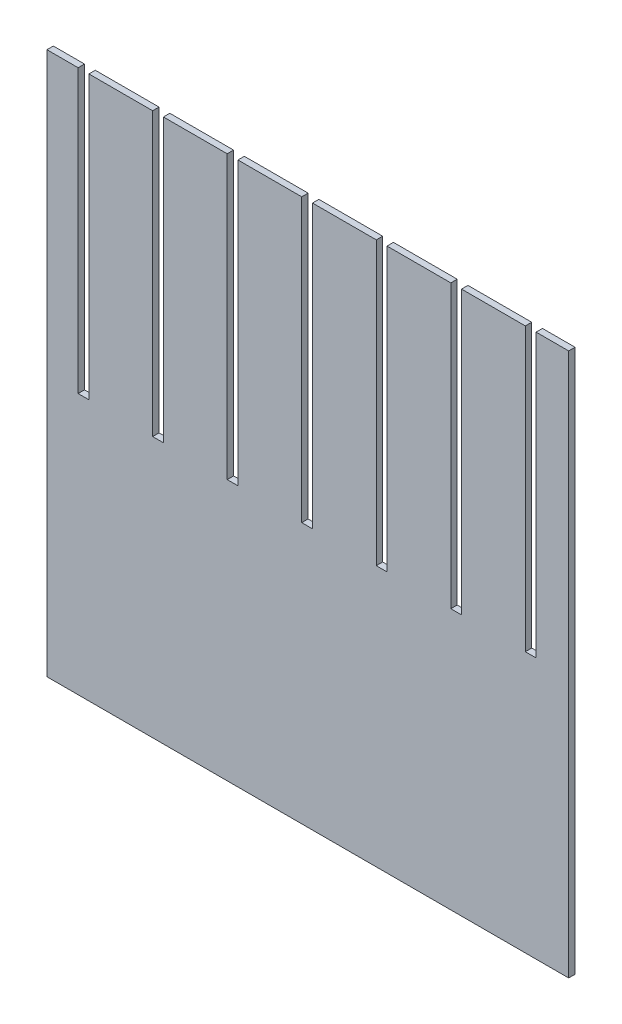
ISO-10303-21;
HEADER;
FILE_DESCRIPTION(('STEP AP214'),'2;1');
FILE_NAME('part.step','',(''),(''),'','','');
FILE_SCHEMA(('AUTOMOTIVE_DESIGN { 1 0 10303 214 1 1 1 1 }'));
ENDSEC;
DATA;
#1=APPLICATION_CONTEXT('core data for automotive mechanical design processes');
#2=APPLICATION_PROTOCOL_DEFINITION('international standard','automotive_design',2000,#1);
#3=PRODUCT_CONTEXT('',#1,'mechanical');
#4=PRODUCT('Part','Part','',(#3));
#5=PRODUCT_RELATED_PRODUCT_CATEGORY('part','',(#4));
#6=PRODUCT_DEFINITION_FORMATION('','',#4);
#7=PRODUCT_DEFINITION_CONTEXT('part definition',#1,'design');
#8=PRODUCT_DEFINITION('design','',#6,#7);
#9=PRODUCT_DEFINITION_SHAPE('','',#8);
#10=(LENGTH_UNIT() NAMED_UNIT(*) SI_UNIT(.MILLI.,.METRE.));
#11=(NAMED_UNIT(*) PLANE_ANGLE_UNIT() SI_UNIT($,.RADIAN.));
#12=(NAMED_UNIT(*) SI_UNIT($,.STERADIAN.) SOLID_ANGLE_UNIT());
#13=UNCERTAINTY_MEASURE_WITH_UNIT(LENGTH_MEASURE(1.E-05),#10,'distance_accuracy_value','');
#14=(GEOMETRIC_REPRESENTATION_CONTEXT(3) GLOBAL_UNCERTAINTY_ASSIGNED_CONTEXT((#13)) GLOBAL_UNIT_ASSIGNED_CONTEXT((#10,
#11,#12)) REPRESENTATION_CONTEXT('',''));
#15=CARTESIAN_POINT('',(0.,0.,0.));
#16=DIRECTION('',(0.,0.,1.));
#17=DIRECTION('',(1.,0.,0.));
#18=AXIS2_PLACEMENT_3D('',#15,#16,#17);
#19=CARTESIAN_POINT('',(-2.93,25.5,0.6));
#20=DIRECTION('',(0.,-1.,0.));
#21=DIRECTION('',(0.,0.,-1.));
#22=AXIS2_PLACEMENT_3D('',#19,#20,#21);
#23=PLANE('',#22);
#24=DIRECTION('',(0.,0.,-1.));
#25=VECTOR('',#24,1.);
#26=CARTESIAN_POINT('',(7.,25.5,0.6));
#27=LINE('',#26,#25);
#28=CARTESIAN_POINT('',(7.,25.5,0.6));
#29=VERTEX_POINT('',#28);
#30=CARTESIAN_POINT('',(7.,25.5,0.));
#31=VERTEX_POINT('',#30);
#32=EDGE_CURVE('E260',#29,#31,#27,.T.);
#33=ORIENTED_EDGE('',*,*,#32,.T.);
#34=DIRECTION('',(-1.,0.,0.));
#35=VECTOR('',#34,1.);
#36=CARTESIAN_POINT('',(-2.93,25.5,0.));
#37=LINE('',#36,#35);
#38=CARTESIAN_POINT('',(1.01,25.5,0.));
#39=VERTEX_POINT('',#38);
#40=EDGE_CURVE('E469',#31,#39,#37,.T.);
#41=ORIENTED_EDGE('',*,*,#40,.T.);
#42=DIRECTION('',(0.,0.,-1.));
#43=VECTOR('',#42,1.);
#44=CARTESIAN_POINT('',(1.01,25.5,0.6));
#45=LINE('',#44,#43);
#46=CARTESIAN_POINT('',(1.01,25.5,0.6));
#47=VERTEX_POINT('',#46);
#48=EDGE_CURVE('E423',#47,#39,#45,.T.);
#49=ORIENTED_EDGE('',*,*,#48,.F.);
#50=DIRECTION('',(-1.,0.,0.));
#51=VECTOR('',#50,1.);
#52=CARTESIAN_POINT('',(-2.93,25.5,0.6));
#53=LINE('',#52,#51);
#54=EDGE_CURVE('E454',#29,#47,#53,.T.);
#55=ORIENTED_EDGE('',*,*,#54,.F.);
#56=EDGE_LOOP('',(#33,#41,#49,#55));
#57=FACE_BOUND('',#56,.T.);
#58=ADVANCED_FACE('F45',(#57),#23,.F.);
#59=DIRECTION('',(0.,0.,-1.));
#60=VECTOR('',#59,1.);
#61=CARTESIAN_POINT('',(8.01,25.5,0.6));
#62=LINE('',#61,#60);
#63=CARTESIAN_POINT('',(8.01,25.5,0.6));
#64=VERTEX_POINT('',#63);
#65=CARTESIAN_POINT('',(8.01,25.5,0.));
#66=VERTEX_POINT('',#65);
#67=EDGE_CURVE('E61',#64,#66,#62,.T.);
#68=ORIENTED_EDGE('',*,*,#67,.F.);
#69=CARTESIAN_POINT('',(14.,25.5,0.6));
#70=VERTEX_POINT('',#69);
#71=EDGE_CURVE('E554',#70,#64,#53,.T.);
#72=ORIENTED_EDGE('',*,*,#71,.F.);
#73=DIRECTION('',(0.,0.,-1.));
#74=VECTOR('',#73,1.);
#75=CARTESIAN_POINT('',(14.,25.5,0.6));
#76=LINE('',#75,#74);
#77=CARTESIAN_POINT('',(14.,25.5,0.));
#78=VERTEX_POINT('',#77);
#79=EDGE_CURVE('E302',#70,#78,#76,.T.);
#80=ORIENTED_EDGE('',*,*,#79,.T.);
#81=EDGE_CURVE('E569',#78,#66,#37,.T.);
#82=ORIENTED_EDGE('',*,*,#81,.T.);
#83=EDGE_LOOP('',(#68,#72,#80,#82));
#84=FACE_BOUND('',#83,.T.);
#85=ADVANCED_FACE('F608',(#84),#23,.F.);
#86=DIRECTION('',(0.,0.,-1.));
#87=VECTOR('',#86,1.);
#88=CARTESIAN_POINT('',(15.01,25.5,0.6));
#89=LINE('',#88,#87);
#90=CARTESIAN_POINT('',(15.01,25.5,0.6));
#91=VERTEX_POINT('',#90);
#92=CARTESIAN_POINT('',(15.01,25.5,0.));
#93=VERTEX_POINT('',#92);
#94=EDGE_CURVE('E69',#91,#93,#89,.T.);
#95=ORIENTED_EDGE('',*,*,#94,.F.);
#96=CARTESIAN_POINT('',(21.,25.5,0.6));
#97=VERTEX_POINT('',#96);
#98=EDGE_CURVE('E551',#97,#91,#53,.T.);
#99=ORIENTED_EDGE('',*,*,#98,.F.);
#100=DIRECTION('',(0.,0.,-1.));
#101=VECTOR('',#100,1.);
#102=CARTESIAN_POINT('',(21.,25.5,0.6));
#103=LINE('',#102,#101);
#104=CARTESIAN_POINT('',(21.,25.5,0.));
#105=VERTEX_POINT('',#104);
#106=EDGE_CURVE('E325',#97,#105,#103,.T.);
#107=ORIENTED_EDGE('',*,*,#106,.T.);
#108=EDGE_CURVE('E566',#105,#93,#37,.T.);
#109=ORIENTED_EDGE('',*,*,#108,.T.);
#110=EDGE_LOOP('',(#95,#99,#107,#109));
#111=FACE_BOUND('',#110,.T.);
#112=ADVANCED_FACE('F614',(#111),#23,.F.);
#113=DIRECTION('',(0.,0.,-1.));
#114=VECTOR('',#113,1.);
#115=CARTESIAN_POINT('',(22.01,25.5,0.6));
#116=LINE('',#115,#114);
#117=CARTESIAN_POINT('',(22.01,25.5,0.6));
#118=VERTEX_POINT('',#117);
#119=CARTESIAN_POINT('',(22.01,25.5,0.));
#120=VERTEX_POINT('',#119);
#121=EDGE_CURVE('E329',#118,#120,#116,.T.);
#122=ORIENTED_EDGE('',*,*,#121,.F.);
#123=CARTESIAN_POINT('',(28.,25.5,0.6));
#124=VERTEX_POINT('',#123);
#125=EDGE_CURVE('E548',#124,#118,#53,.T.);
#126=ORIENTED_EDGE('',*,*,#125,.F.);
#127=DIRECTION('',(0.,0.,-1.));
#128=VECTOR('',#127,1.);
#129=CARTESIAN_POINT('',(28.,25.5,0.6));
#130=LINE('',#129,#128);
#131=CARTESIAN_POINT('',(28.,25.5,0.));
#132=VERTEX_POINT('',#131);
#133=EDGE_CURVE('E349',#124,#132,#130,.T.);
#134=ORIENTED_EDGE('',*,*,#133,.T.);
#135=EDGE_CURVE('E563',#132,#120,#37,.T.);
#136=ORIENTED_EDGE('',*,*,#135,.T.);
#137=EDGE_LOOP('',(#122,#126,#134,#136));
#138=FACE_BOUND('',#137,.T.);
#139=ADVANCED_FACE('F694',(#138),#23,.F.);
#140=DIRECTION('',(0.,0.,-1.));
#141=VECTOR('',#140,1.);
#142=CARTESIAN_POINT('',(29.01,25.5,0.6));
#143=LINE('',#142,#141);
#144=CARTESIAN_POINT('',(29.01,25.5,0.6));
#145=VERTEX_POINT('',#144);
#146=CARTESIAN_POINT('',(29.01,25.5,0.));
#147=VERTEX_POINT('',#146);
#148=EDGE_CURVE('E353',#145,#147,#143,.T.);
#149=ORIENTED_EDGE('',*,*,#148,.F.);
#150=CARTESIAN_POINT('',(35.,25.5,0.6));
#151=VERTEX_POINT('',#150);
#152=EDGE_CURVE('E545',#151,#145,#53,.T.);
#153=ORIENTED_EDGE('',*,*,#152,.F.);
#154=DIRECTION('',(0.,0.,-1.));
#155=VECTOR('',#154,1.);
#156=CARTESIAN_POINT('',(35.,25.5,0.6));
#157=LINE('',#156,#155);
#158=CARTESIAN_POINT('',(35.,25.5,0.));
#159=VERTEX_POINT('',#158);
#160=EDGE_CURVE('E373',#151,#159,#157,.T.);
#161=ORIENTED_EDGE('',*,*,#160,.T.);
#162=EDGE_CURVE('E560',#159,#147,#37,.T.);
#163=ORIENTED_EDGE('',*,*,#162,.T.);
#164=EDGE_LOOP('',(#149,#153,#161,#163));
#165=FACE_BOUND('',#164,.T.);
#166=ADVANCED_FACE('F634',(#165),#23,.F.);
#167=DIRECTION('',(0.,0.,-1.));
#168=VECTOR('',#167,1.);
#169=CARTESIAN_POINT('',(36.01,25.5,0.6));
#170=LINE('',#169,#168);
#171=CARTESIAN_POINT('',(36.01,25.5,0.6));
#172=VERTEX_POINT('',#171);
#173=CARTESIAN_POINT('',(36.01,25.5,0.));
#174=VERTEX_POINT('',#173);
#175=EDGE_CURVE('E377',#172,#174,#170,.T.);
#176=ORIENTED_EDGE('',*,*,#175,.F.);
#177=CARTESIAN_POINT('',(42.,25.5,0.6));
#178=VERTEX_POINT('',#177);
#179=EDGE_CURVE('E453',#178,#172,#53,.T.);
#180=ORIENTED_EDGE('',*,*,#179,.F.);
#181=DIRECTION('',(0.,0.,-1.));
#182=VECTOR('',#181,1.);
#183=CARTESIAN_POINT('',(42.,25.5,0.6));
#184=LINE('',#183,#182);
#185=CARTESIAN_POINT('',(42.,25.5,0.));
#186=VERTEX_POINT('',#185);
#187=EDGE_CURVE('E396',#178,#186,#184,.T.);
#188=ORIENTED_EDGE('',*,*,#187,.T.);
#189=EDGE_CURVE('E468',#186,#174,#37,.T.);
#190=ORIENTED_EDGE('',*,*,#189,.T.);
#191=EDGE_LOOP('',(#176,#180,#188,#190));
#192=FACE_BOUND('',#191,.T.);
#193=ADVANCED_FACE('F627',(#192),#23,.F.);
#194=DIRECTION('',(0.,0.,-1.));
#195=VECTOR('',#194,1.);
#196=CARTESIAN_POINT('',(43.01,25.5,0.6));
#197=LINE('',#196,#195);
#198=CARTESIAN_POINT('',(43.01,25.5,0.6));
#199=VERTEX_POINT('',#198);
#200=CARTESIAN_POINT('',(43.01,25.5,0.));
#201=VERTEX_POINT('',#200);
#202=EDGE_CURVE('E400',#199,#201,#197,.T.);
#203=ORIENTED_EDGE('',*,*,#202,.F.);
#204=CARTESIAN_POINT('',(46.07,25.5,0.6));
#205=VERTEX_POINT('',#204);
#206=EDGE_CURVE('E448',#205,#199,#53,.T.);
#207=ORIENTED_EDGE('',*,*,#206,.F.);
#208=DIRECTION('',(0.,0.,-1.));
#209=VECTOR('',#208,1.);
#210=CARTESIAN_POINT('',(46.07,25.5,0.6));
#211=LINE('',#210,#209);
#212=CARTESIAN_POINT('',(46.07,25.5,0.));
#213=VERTEX_POINT('',#212);
#214=EDGE_CURVE('E473',#205,#213,#211,.T.);
#215=ORIENTED_EDGE('',*,*,#214,.T.);
#216=EDGE_CURVE('E441',#213,#201,#37,.T.);
#217=ORIENTED_EDGE('',*,*,#216,.T.);
#218=EDGE_LOOP('',(#203,#207,#215,#217));
#219=FACE_BOUND('',#218,.T.);
#220=ADVANCED_FACE('F619',(#219),#23,.F.);
#221=CARTESIAN_POINT('',(0.,0.,0.6));
#222=DIRECTION('',(0.,0.,1.));
#223=DIRECTION('',(1.,0.,0.));
#224=AXIS2_PLACEMENT_3D('',#221,#222,#223);
#225=PLANE('',#224);
#226=DIRECTION('',(1.,0.,0.));
#227=VECTOR('',#226,1.);
#228=CARTESIAN_POINT('',(7.,-1.,0.6));
#229=LINE('',#228,#227);
#230=CARTESIAN_POINT('',(7.,-1.,0.6));
#231=VERTEX_POINT('',#230);
#232=CARTESIAN_POINT('',(8.01,-1.,0.6));
#233=VERTEX_POINT('',#232);
#234=EDGE_CURVE('E265',#231,#233,#229,.T.);
#235=ORIENTED_EDGE('',*,*,#234,.F.);
#236=DIRECTION('',(0.,-1.,0.));
#237=VECTOR('',#236,1.);
#238=CARTESIAN_POINT('',(7.,25.5,0.6));
#239=LINE('',#238,#237);
#240=EDGE_CURVE('E254',#29,#231,#239,.T.);
#241=ORIENTED_EDGE('',*,*,#240,.F.);
#242=ORIENTED_EDGE('',*,*,#54,.T.);
#243=DIRECTION('',(0.,1.,0.));
#244=VECTOR('',#243,1.);
#245=CARTESIAN_POINT('',(1.01,25.5,0.6));
#246=LINE('',#245,#244);
#247=CARTESIAN_POINT('',(1.01,-1.,0.6));
#248=VERTEX_POINT('',#247);
#249=EDGE_CURVE('E415',#248,#47,#246,.T.);
#250=ORIENTED_EDGE('',*,*,#249,.F.);
#251=DIRECTION('',(1.,0.,0.));
#252=VECTOR('',#251,1.);
#253=CARTESIAN_POINT('',(0.,-1.,0.6));
#254=LINE('',#253,#252);
#255=CARTESIAN_POINT('',(0.,-1.,0.6));
#256=VERTEX_POINT('',#255);
#257=EDGE_CURVE('E412',#256,#248,#254,.T.);
#258=ORIENTED_EDGE('',*,*,#257,.F.);
#259=DIRECTION('',(0.,-1.,0.));
#260=VECTOR('',#259,1.);
#261=CARTESIAN_POINT('',(0.,25.5,0.6));
#262=LINE('',#261,#260);
#263=CARTESIAN_POINT('',(0.,25.5,0.6));
#264=VERTEX_POINT('',#263);
#265=EDGE_CURVE('E274',#264,#256,#262,.T.);
#266=ORIENTED_EDGE('',*,*,#265,.F.);
#267=CARTESIAN_POINT('',(-2.93,25.5,0.6));
#268=VERTEX_POINT('',#267);
#269=EDGE_CURVE('E447',#264,#268,#53,.T.);
#270=ORIENTED_EDGE('',*,*,#269,.T.);
#271=DIRECTION('',(0.,-1.,0.));
#272=VECTOR('',#271,1.);
#273=CARTESIAN_POINT('',(-2.93,25.5,0.6));
#274=LINE('',#273,#272);
#275=CARTESIAN_POINT('',(-2.93,-25.5,0.6));
#276=VERTEX_POINT('',#275);
#277=EDGE_CURVE('E436',#268,#276,#274,.T.);
#278=ORIENTED_EDGE('',*,*,#277,.T.);
#279=DIRECTION('',(1.,0.,0.));
#280=VECTOR('',#279,1.);
#281=CARTESIAN_POINT('',(-2.93,-25.5,0.6));
#282=LINE('',#281,#280);
#283=CARTESIAN_POINT('',(46.07,-25.5,0.6));
#284=VERTEX_POINT('',#283);
#285=EDGE_CURVE('E440',#276,#284,#282,.T.);
#286=ORIENTED_EDGE('',*,*,#285,.T.);
#287=DIRECTION('',(0.,1.,0.));
#288=VECTOR('',#287,1.);
#289=CARTESIAN_POINT('',(46.07,25.5,0.6));
#290=LINE('',#289,#288);
#291=EDGE_CURVE('E444',#284,#205,#290,.T.);
#292=ORIENTED_EDGE('',*,*,#291,.T.);
#293=ORIENTED_EDGE('',*,*,#206,.T.);
#294=DIRECTION('',(0.,1.,0.));
#295=VECTOR('',#294,1.);
#296=CARTESIAN_POINT('',(43.01,25.5,0.6));
#297=LINE('',#296,#295);
#298=CARTESIAN_POINT('',(43.01,-1.,0.6));
#299=VERTEX_POINT('',#298);
#300=EDGE_CURVE('E393',#299,#199,#297,.T.);
#301=ORIENTED_EDGE('',*,*,#300,.F.);
#302=DIRECTION('',(1.,0.,0.));
#303=VECTOR('',#302,1.);
#304=CARTESIAN_POINT('',(42.,-1.,0.6));
#305=LINE('',#304,#303);
#306=CARTESIAN_POINT('',(42.,-1.,0.6));
#307=VERTEX_POINT('',#306);
#308=EDGE_CURVE('E390',#307,#299,#305,.T.);
#309=ORIENTED_EDGE('',*,*,#308,.F.);
#310=DIRECTION('',(0.,-1.,0.));
#311=VECTOR('',#310,1.);
#312=CARTESIAN_POINT('',(42.,25.5,0.6));
#313=LINE('',#312,#311);
#314=EDGE_CURVE('E387',#178,#307,#313,.T.);
#315=ORIENTED_EDGE('',*,*,#314,.F.);
#316=ORIENTED_EDGE('',*,*,#179,.T.);
#317=DIRECTION('',(0.,1.,0.));
#318=VECTOR('',#317,1.);
#319=CARTESIAN_POINT('',(36.01,25.5,0.6));
#320=LINE('',#319,#318);
#321=CARTESIAN_POINT('',(36.01,-1.,0.6));
#322=VERTEX_POINT('',#321);
#323=EDGE_CURVE('E370',#322,#172,#320,.T.);
#324=ORIENTED_EDGE('',*,*,#323,.F.);
#325=DIRECTION('',(1.,0.,0.));
#326=VECTOR('',#325,1.);
#327=CARTESIAN_POINT('',(35.,-1.,0.6));
#328=LINE('',#327,#326);
#329=CARTESIAN_POINT('',(35.,-1.,0.6));
#330=VERTEX_POINT('',#329);
#331=EDGE_CURVE('E366',#330,#322,#328,.T.);
#332=ORIENTED_EDGE('',*,*,#331,.F.);
#333=DIRECTION('',(0.,-1.,0.));
#334=VECTOR('',#333,1.);
#335=CARTESIAN_POINT('',(35.,25.5,0.6));
#336=LINE('',#335,#334);
#337=EDGE_CURVE('E363',#151,#330,#336,.T.);
#338=ORIENTED_EDGE('',*,*,#337,.F.);
#339=ORIENTED_EDGE('',*,*,#152,.T.);
#340=DIRECTION('',(0.,1.,0.));
#341=VECTOR('',#340,1.);
#342=CARTESIAN_POINT('',(29.01,25.5,0.6));
#343=LINE('',#342,#341);
#344=CARTESIAN_POINT('',(29.01,-1.,0.6));
#345=VERTEX_POINT('',#344);
#346=EDGE_CURVE('E346',#345,#145,#343,.T.);
#347=ORIENTED_EDGE('',*,*,#346,.F.);
#348=DIRECTION('',(1.,0.,0.));
#349=VECTOR('',#348,1.);
#350=CARTESIAN_POINT('',(28.,-1.,0.6));
#351=LINE('',#350,#349);
#352=CARTESIAN_POINT('',(28.,-1.,0.6));
#353=VERTEX_POINT('',#352);
#354=EDGE_CURVE('E342',#353,#345,#351,.T.);
#355=ORIENTED_EDGE('',*,*,#354,.F.);
#356=DIRECTION('',(0.,-1.,0.));
#357=VECTOR('',#356,1.);
#358=CARTESIAN_POINT('',(28.,25.5,0.6));
#359=LINE('',#358,#357);
#360=EDGE_CURVE('E339',#124,#353,#359,.T.);
#361=ORIENTED_EDGE('',*,*,#360,.F.);
#362=ORIENTED_EDGE('',*,*,#125,.T.);
#363=DIRECTION('',(0.,1.,0.));
#364=VECTOR('',#363,1.);
#365=CARTESIAN_POINT('',(22.01,25.5,0.6));
#366=LINE('',#365,#364);
#367=CARTESIAN_POINT('',(22.01,-1.,0.6));
#368=VERTEX_POINT('',#367);
#369=EDGE_CURVE('E322',#368,#118,#366,.T.);
#370=ORIENTED_EDGE('',*,*,#369,.F.);
#371=DIRECTION('',(1.,0.,0.));
#372=VECTOR('',#371,1.);
#373=CARTESIAN_POINT('',(21.,-1.,0.6));
#374=LINE('',#373,#372);
#375=CARTESIAN_POINT('',(21.,-1.,0.6));
#376=VERTEX_POINT('',#375);
#377=EDGE_CURVE('E318',#376,#368,#374,.T.);
#378=ORIENTED_EDGE('',*,*,#377,.F.);
#379=DIRECTION('',(0.,-1.,0.));
#380=VECTOR('',#379,1.);
#381=CARTESIAN_POINT('',(21.,25.5,0.6));
#382=LINE('',#381,#380);
#383=EDGE_CURVE('E315',#97,#376,#382,.T.);
#384=ORIENTED_EDGE('',*,*,#383,.F.);
#385=ORIENTED_EDGE('',*,*,#98,.T.);
#386=DIRECTION('',(0.,1.,0.));
#387=VECTOR('',#386,1.);
#388=CARTESIAN_POINT('',(15.01,25.5,0.6));
#389=LINE('',#388,#387);
#390=CARTESIAN_POINT('',(15.01,-1.,0.6));
#391=VERTEX_POINT('',#390);
#392=EDGE_CURVE('E299',#391,#91,#389,.T.);
#393=ORIENTED_EDGE('',*,*,#392,.F.);
#394=DIRECTION('',(1.,0.,0.));
#395=VECTOR('',#394,1.);
#396=CARTESIAN_POINT('',(14.,-1.,0.6));
#397=LINE('',#396,#395);
#398=CARTESIAN_POINT('',(14.,-1.,0.6));
#399=VERTEX_POINT('',#398);
#400=EDGE_CURVE('E295',#399,#391,#397,.T.);
#401=ORIENTED_EDGE('',*,*,#400,.F.);
#402=DIRECTION('',(0.,-1.,0.));
#403=VECTOR('',#402,1.);
#404=CARTESIAN_POINT('',(14.,25.5,0.6));
#405=LINE('',#404,#403);
#406=EDGE_CURVE('E292',#70,#399,#405,.T.);
#407=ORIENTED_EDGE('',*,*,#406,.F.);
#408=ORIENTED_EDGE('',*,*,#71,.T.);
#409=DIRECTION('',(0.,1.,0.));
#410=VECTOR('',#409,1.);
#411=CARTESIAN_POINT('',(8.01,25.5,0.6));
#412=LINE('',#411,#410);
#413=EDGE_CURVE('E280',#233,#64,#412,.T.);
#414=ORIENTED_EDGE('',*,*,#413,.F.);
#415=EDGE_LOOP('',(#235,#241,#242,#250,#258,#266,#270,#278,#286,#292,#293,#301,#309,#315,#316,
#324,#332,#338,#339,#347,#355,#361,#362,#370,#378,#384,#385,#393,#401,#407,#408,#414));
#416=FACE_BOUND('',#415,.T.);
#417=ADVANCED_FACE('F278',(#416),#225,.T.);
#418=CARTESIAN_POINT('',(0.,0.,0.));
#419=DIRECTION('',(0.,0.,1.));
#420=DIRECTION('',(1.,0.,0.));
#421=AXIS2_PLACEMENT_3D('',#418,#419,#420);
#422=PLANE('',#421);
#423=DIRECTION('',(0.,1.,0.));
#424=VECTOR('',#423,1.);
#425=CARTESIAN_POINT('',(7.,0.,0.));
#426=LINE('',#425,#424);
#427=CARTESIAN_POINT('',(7.,-1.,0.));
#428=VERTEX_POINT('',#427);
#429=EDGE_CURVE('E11',#428,#31,#426,.T.);
#430=ORIENTED_EDGE('',*,*,#429,.F.);
#431=DIRECTION('',(-1.,0.,0.));
#432=VECTOR('',#431,1.);
#433=CARTESIAN_POINT('',(0.,-1.,0.));
#434=LINE('',#433,#432);
#435=CARTESIAN_POINT('',(8.01,-1.,0.));
#436=VERTEX_POINT('',#435);
#437=EDGE_CURVE('E54',#436,#428,#434,.T.);
#438=ORIENTED_EDGE('',*,*,#437,.F.);
#439=DIRECTION('',(0.,-1.,0.));
#440=VECTOR('',#439,1.);
#441=CARTESIAN_POINT('',(8.01,0.,0.));
#442=LINE('',#441,#440);
#443=EDGE_CURVE('E539',#66,#436,#442,.T.);
#444=ORIENTED_EDGE('',*,*,#443,.F.);
#445=ORIENTED_EDGE('',*,*,#81,.F.);
#446=DIRECTION('',(0.,1.,0.));
#447=VECTOR('',#446,1.);
#448=CARTESIAN_POINT('',(14.,0.,0.));
#449=LINE('',#448,#447);
#450=CARTESIAN_POINT('',(14.,-1.,0.));
#451=VERTEX_POINT('',#450);
#452=EDGE_CURVE('E536',#451,#78,#449,.T.);
#453=ORIENTED_EDGE('',*,*,#452,.F.);
#454=DIRECTION('',(-1.,0.,0.));
#455=VECTOR('',#454,1.);
#456=CARTESIAN_POINT('',(0.,-1.,0.));
#457=LINE('',#456,#455);
#458=CARTESIAN_POINT('',(15.01,-1.,0.));
#459=VERTEX_POINT('',#458);
#460=EDGE_CURVE('E533',#459,#451,#457,.T.);
#461=ORIENTED_EDGE('',*,*,#460,.F.);
#462=DIRECTION('',(0.,-1.,0.));
#463=VECTOR('',#462,1.);
#464=CARTESIAN_POINT('',(15.01,0.,0.));
#465=LINE('',#464,#463);
#466=EDGE_CURVE('E530',#93,#459,#465,.T.);
#467=ORIENTED_EDGE('',*,*,#466,.F.);
#468=ORIENTED_EDGE('',*,*,#108,.F.);
#469=DIRECTION('',(0.,1.,0.));
#470=VECTOR('',#469,1.);
#471=CARTESIAN_POINT('',(21.,0.,0.));
#472=LINE('',#471,#470);
#473=CARTESIAN_POINT('',(21.,-1.,0.));
#474=VERTEX_POINT('',#473);
#475=EDGE_CURVE('E527',#474,#105,#472,.T.);
#476=ORIENTED_EDGE('',*,*,#475,.F.);
#477=DIRECTION('',(-1.,0.,0.));
#478=VECTOR('',#477,1.);
#479=CARTESIAN_POINT('',(0.,-1.,0.));
#480=LINE('',#479,#478);
#481=CARTESIAN_POINT('',(22.01,-1.,0.));
#482=VERTEX_POINT('',#481);
#483=EDGE_CURVE('E524',#482,#474,#480,.T.);
#484=ORIENTED_EDGE('',*,*,#483,.F.);
#485=DIRECTION('',(0.,-1.,0.));
#486=VECTOR('',#485,1.);
#487=CARTESIAN_POINT('',(22.01,0.,0.));
#488=LINE('',#487,#486);
#489=EDGE_CURVE('E521',#120,#482,#488,.T.);
#490=ORIENTED_EDGE('',*,*,#489,.F.);
#491=ORIENTED_EDGE('',*,*,#135,.F.);
#492=DIRECTION('',(0.,1.,0.));
#493=VECTOR('',#492,1.);
#494=CARTESIAN_POINT('',(28.,0.,0.));
#495=LINE('',#494,#493);
#496=CARTESIAN_POINT('',(28.,-1.,0.));
#497=VERTEX_POINT('',#496);
#498=EDGE_CURVE('E518',#497,#132,#495,.T.);
#499=ORIENTED_EDGE('',*,*,#498,.F.);
#500=DIRECTION('',(-1.,0.,0.));
#501=VECTOR('',#500,1.);
#502=CARTESIAN_POINT('',(0.,-1.,0.));
#503=LINE('',#502,#501);
#504=CARTESIAN_POINT('',(29.01,-1.,0.));
#505=VERTEX_POINT('',#504);
#506=EDGE_CURVE('E515',#505,#497,#503,.T.);
#507=ORIENTED_EDGE('',*,*,#506,.F.);
#508=DIRECTION('',(0.,-1.,0.));
#509=VECTOR('',#508,1.);
#510=CARTESIAN_POINT('',(29.01,0.,0.));
#511=LINE('',#510,#509);
#512=EDGE_CURVE('E512',#147,#505,#511,.T.);
#513=ORIENTED_EDGE('',*,*,#512,.F.);
#514=ORIENTED_EDGE('',*,*,#162,.F.);
#515=DIRECTION('',(0.,1.,0.));
#516=VECTOR('',#515,1.);
#517=CARTESIAN_POINT('',(35.,0.,0.));
#518=LINE('',#517,#516);
#519=CARTESIAN_POINT('',(35.,-1.,0.));
#520=VERTEX_POINT('',#519);
#521=EDGE_CURVE('E509',#520,#159,#518,.T.);
#522=ORIENTED_EDGE('',*,*,#521,.F.);
#523=DIRECTION('',(-1.,0.,0.));
#524=VECTOR('',#523,1.);
#525=CARTESIAN_POINT('',(0.,-1.,0.));
#526=LINE('',#525,#524);
#527=CARTESIAN_POINT('',(36.01,-1.,0.));
#528=VERTEX_POINT('',#527);
#529=EDGE_CURVE('E506',#528,#520,#526,.T.);
#530=ORIENTED_EDGE('',*,*,#529,.F.);
#531=DIRECTION('',(0.,-1.,0.));
#532=VECTOR('',#531,1.);
#533=CARTESIAN_POINT('',(36.01,0.,0.));
#534=LINE('',#533,#532);
#535=EDGE_CURVE('E503',#174,#528,#534,.T.);
#536=ORIENTED_EDGE('',*,*,#535,.F.);
#537=ORIENTED_EDGE('',*,*,#189,.F.);
#538=DIRECTION('',(0.,1.,0.));
#539=VECTOR('',#538,1.);
#540=CARTESIAN_POINT('',(42.,0.,0.));
#541=LINE('',#540,#539);
#542=CARTESIAN_POINT('',(42.,-1.,0.));
#543=VERTEX_POINT('',#542);
#544=EDGE_CURVE('E500',#543,#186,#541,.T.);
#545=ORIENTED_EDGE('',*,*,#544,.F.);
#546=DIRECTION('',(-1.,0.,0.));
#547=VECTOR('',#546,1.);
#548=CARTESIAN_POINT('',(0.,-1.,0.));
#549=LINE('',#548,#547);
#550=CARTESIAN_POINT('',(43.01,-1.,0.));
#551=VERTEX_POINT('',#550);
#552=EDGE_CURVE('E497',#551,#543,#549,.T.);
#553=ORIENTED_EDGE('',*,*,#552,.F.);
#554=DIRECTION('',(0.,-1.,0.));
#555=VECTOR('',#554,1.);
#556=CARTESIAN_POINT('',(43.01,0.,0.));
#557=LINE('',#556,#555);
#558=EDGE_CURVE('E494',#201,#551,#557,.T.);
#559=ORIENTED_EDGE('',*,*,#558,.F.);
#560=ORIENTED_EDGE('',*,*,#216,.F.);
#561=DIRECTION('',(0.,1.,0.));
#562=VECTOR('',#561,1.);
#563=CARTESIAN_POINT('',(46.07,25.5,0.));
#564=LINE('',#563,#562);
#565=CARTESIAN_POINT('',(46.07,-25.5,0.));
#566=VERTEX_POINT('',#565);
#567=EDGE_CURVE('E461',#566,#213,#564,.T.);
#568=ORIENTED_EDGE('',*,*,#567,.F.);
#569=DIRECTION('',(1.,0.,0.));
#570=VECTOR('',#569,1.);
#571=CARTESIAN_POINT('',(-2.93,-25.5,0.));
#572=LINE('',#571,#570);
#573=CARTESIAN_POINT('',(-2.93,-25.5,0.));
#574=VERTEX_POINT('',#573);
#575=EDGE_CURVE('E458',#574,#566,#572,.T.);
#576=ORIENTED_EDGE('',*,*,#575,.F.);
#577=DIRECTION('',(0.,-1.,0.));
#578=VECTOR('',#577,1.);
#579=CARTESIAN_POINT('',(-2.93,25.5,0.));
#580=LINE('',#579,#578);
#581=CARTESIAN_POINT('',(-2.93,25.5,0.));
#582=VERTEX_POINT('',#581);
#583=EDGE_CURVE('E435',#582,#574,#580,.T.);
#584=ORIENTED_EDGE('',*,*,#583,.F.);
#585=CARTESIAN_POINT('',(0.,25.5,0.));
#586=VERTEX_POINT('',#585);
#587=EDGE_CURVE('E464',#586,#582,#37,.T.);
#588=ORIENTED_EDGE('',*,*,#587,.F.);
#589=DIRECTION('',(0.,1.,0.));
#590=VECTOR('',#589,1.);
#591=CARTESIAN_POINT('',(0.,0.,0.));
#592=LINE('',#591,#590);
#593=CARTESIAN_POINT('',(0.,-1.,0.));
#594=VERTEX_POINT('',#593);
#595=EDGE_CURVE('E491',#594,#586,#592,.T.);
#596=ORIENTED_EDGE('',*,*,#595,.F.);
#597=DIRECTION('',(-1.,0.,0.));
#598=VECTOR('',#597,1.);
#599=CARTESIAN_POINT('',(0.,-1.,0.));
#600=LINE('',#599,#598);
#601=CARTESIAN_POINT('',(1.01,-1.,0.));
#602=VERTEX_POINT('',#601);
#603=EDGE_CURVE('E488',#602,#594,#600,.T.);
#604=ORIENTED_EDGE('',*,*,#603,.F.);
#605=DIRECTION('',(0.,-1.,0.));
#606=VECTOR('',#605,1.);
#607=CARTESIAN_POINT('',(1.01,0.,0.));
#608=LINE('',#607,#606);
#609=EDGE_CURVE('E485',#39,#602,#608,.T.);
#610=ORIENTED_EDGE('',*,*,#609,.F.);
#611=ORIENTED_EDGE('',*,*,#40,.F.);
#612=EDGE_LOOP('',(#430,#438,#444,#445,#453,#461,#467,#468,#476,#484,#490,#491,#499,#507,#513,
#514,#522,#530,#536,#537,#545,#553,#559,#560,#568,#576,#584,#588,#596,#604,#610,#611));
#613=FACE_BOUND('',#612,.T.);
#614=ADVANCED_FACE('F584',(#613),#422,.F.);
#615=DIRECTION('',(0.,0.,-1.));
#616=VECTOR('',#615,1.);
#617=CARTESIAN_POINT('',(0.,25.5,0.6));
#618=LINE('',#617,#616);
#619=EDGE_CURVE('E419',#264,#586,#618,.T.);
#620=ORIENTED_EDGE('',*,*,#619,.T.);
#621=ORIENTED_EDGE('',*,*,#587,.T.);
#622=DIRECTION('',(0.,0.,-1.));
#623=VECTOR('',#622,1.);
#624=CARTESIAN_POINT('',(-2.93,25.5,0.6));
#625=LINE('',#624,#623);
#626=EDGE_CURVE('E452',#268,#582,#625,.T.);
#627=ORIENTED_EDGE('',*,*,#626,.F.);
#628=ORIENTED_EDGE('',*,*,#269,.F.);
#629=EDGE_LOOP('',(#620,#621,#627,#628));
#630=FACE_BOUND('',#629,.T.);
#631=ADVANCED_FACE('F576',(#630),#23,.F.);
#632=CARTESIAN_POINT('',(-2.93,25.5,0.6));
#633=DIRECTION('',(1.,0.,0.));
#634=DIRECTION('',(0.,0.,-1.));
#635=AXIS2_PLACEMENT_3D('',#632,#633,#634);
#636=PLANE('',#635);
#637=ORIENTED_EDGE('',*,*,#583,.T.);
#638=DIRECTION('',(0.,0.,-1.));
#639=VECTOR('',#638,1.);
#640=CARTESIAN_POINT('',(-2.93,-25.5,0.6));
#641=LINE('',#640,#639);
#642=EDGE_CURVE('E481',#276,#574,#641,.T.);
#643=ORIENTED_EDGE('',*,*,#642,.F.);
#644=ORIENTED_EDGE('',*,*,#277,.F.);
#645=ORIENTED_EDGE('',*,*,#626,.T.);
#646=EDGE_LOOP('',(#637,#643,#644,#645));
#647=FACE_BOUND('',#646,.T.);
#648=ADVANCED_FACE('F47',(#647),#636,.F.);
#649=CARTESIAN_POINT('',(-2.93,-25.5,0.6));
#650=DIRECTION('',(0.,1.,0.));
#651=DIRECTION('',(0.,0.,1.));
#652=AXIS2_PLACEMENT_3D('',#649,#650,#651);
#653=PLANE('',#652);
#654=ORIENTED_EDGE('',*,*,#575,.T.);
#655=DIRECTION('',(0.,0.,-1.));
#656=VECTOR('',#655,1.);
#657=CARTESIAN_POINT('',(46.07,-25.5,0.6));
#658=LINE('',#657,#656);
#659=EDGE_CURVE('E477',#284,#566,#658,.T.);
#660=ORIENTED_EDGE('',*,*,#659,.F.);
#661=ORIENTED_EDGE('',*,*,#285,.F.);
#662=ORIENTED_EDGE('',*,*,#642,.T.);
#663=EDGE_LOOP('',(#654,#660,#661,#662));
#664=FACE_BOUND('',#663,.T.);
#665=ADVANCED_FACE('F589',(#664),#653,.F.);
#666=CARTESIAN_POINT('',(46.07,25.5,0.6));
#667=DIRECTION('',(-1.,0.,0.));
#668=DIRECTION('',(0.,0.,1.));
#669=AXIS2_PLACEMENT_3D('',#666,#667,#668);
#670=PLANE('',#669);
#671=ORIENTED_EDGE('',*,*,#567,.T.);
#672=ORIENTED_EDGE('',*,*,#214,.F.);
#673=ORIENTED_EDGE('',*,*,#291,.F.);
#674=ORIENTED_EDGE('',*,*,#659,.T.);
#675=EDGE_LOOP('',(#671,#672,#673,#674));
#676=FACE_BOUND('',#675,.T.);
#677=ADVANCED_FACE('F644',(#676),#670,.F.);
#678=CARTESIAN_POINT('',(0.,25.5,0.6));
#679=DIRECTION('',(1.,0.,0.));
#680=DIRECTION('',(0.,0.,-1.));
#681=AXIS2_PLACEMENT_3D('',#678,#679,#680);
#682=PLANE('',#681);
#683=ORIENTED_EDGE('',*,*,#595,.T.);
#684=ORIENTED_EDGE('',*,*,#619,.F.);
#685=ORIENTED_EDGE('',*,*,#265,.T.);
#686=DIRECTION('',(0.,0.,-1.));
#687=VECTOR('',#686,1.);
#688=CARTESIAN_POINT('',(0.,-1.,0.6));
#689=LINE('',#688,#687);
#690=EDGE_CURVE('E431',#256,#594,#689,.T.);
#691=ORIENTED_EDGE('',*,*,#690,.T.);
#692=EDGE_LOOP('',(#683,#684,#685,#691));
#693=FACE_BOUND('',#692,.T.);
#694=ADVANCED_FACE('F596',(#693),#682,.T.);
#695=CARTESIAN_POINT('',(0.,-1.,0.6));
#696=DIRECTION('',(0.,1.,0.));
#697=DIRECTION('',(0.,0.,1.));
#698=AXIS2_PLACEMENT_3D('',#695,#696,#697);
#699=PLANE('',#698);
#700=ORIENTED_EDGE('',*,*,#603,.T.);
#701=ORIENTED_EDGE('',*,*,#690,.F.);
#702=ORIENTED_EDGE('',*,*,#257,.T.);
#703=DIRECTION('',(0.,0.,-1.));
#704=VECTOR('',#703,1.);
#705=CARTESIAN_POINT('',(1.01,-1.,0.6));
#706=LINE('',#705,#704);
#707=EDGE_CURVE('E427',#248,#602,#706,.T.);
#708=ORIENTED_EDGE('',*,*,#707,.T.);
#709=EDGE_LOOP('',(#700,#701,#702,#708));
#710=FACE_BOUND('',#709,.T.);
#711=ADVANCED_FACE('F598',(#710),#699,.T.);
#712=CARTESIAN_POINT('',(1.01,25.5,0.6));
#713=DIRECTION('',(-1.,0.,0.));
#714=DIRECTION('',(0.,-1.,0.));
#715=AXIS2_PLACEMENT_3D('',#712,#713,#714);
#716=PLANE('',#715);
#717=ORIENTED_EDGE('',*,*,#609,.T.);
#718=ORIENTED_EDGE('',*,*,#707,.F.);
#719=ORIENTED_EDGE('',*,*,#249,.T.);
#720=ORIENTED_EDGE('',*,*,#48,.T.);
#721=EDGE_LOOP('',(#717,#718,#719,#720));
#722=FACE_BOUND('',#721,.T.);
#723=ADVANCED_FACE('F604',(#722),#716,.T.);
#724=CARTESIAN_POINT('',(42.,25.5,0.6));
#725=DIRECTION('',(1.,0.,0.));
#726=DIRECTION('',(0.,0.,-1.));
#727=AXIS2_PLACEMENT_3D('',#724,#725,#726);
#728=PLANE('',#727);
#729=ORIENTED_EDGE('',*,*,#544,.T.);
#730=ORIENTED_EDGE('',*,*,#187,.F.);
#731=ORIENTED_EDGE('',*,*,#314,.T.);
#732=DIRECTION('',(0.,0.,-1.));
#733=VECTOR('',#732,1.);
#734=CARTESIAN_POINT('',(42.,-1.,0.6));
#735=LINE('',#734,#733);
#736=EDGE_CURVE('E367',#307,#543,#735,.T.);
#737=ORIENTED_EDGE('',*,*,#736,.T.);
#738=EDGE_LOOP('',(#729,#730,#731,#737));
#739=FACE_BOUND('',#738,.T.);
#740=ADVANCED_FACE('F763',(#739),#728,.T.);
#741=CARTESIAN_POINT('',(42.,-1.,0.6));
#742=DIRECTION('',(0.,1.,0.));
#743=DIRECTION('',(0.,0.,1.));
#744=AXIS2_PLACEMENT_3D('',#741,#742,#743);
#745=PLANE('',#744);
#746=ORIENTED_EDGE('',*,*,#552,.T.);
#747=ORIENTED_EDGE('',*,*,#736,.F.);
#748=ORIENTED_EDGE('',*,*,#308,.T.);
#749=DIRECTION('',(0.,0.,-1.));
#750=VECTOR('',#749,1.);
#751=CARTESIAN_POINT('',(43.01,-1.,0.6));
#752=LINE('',#751,#750);
#753=EDGE_CURVE('E403',#299,#551,#752,.T.);
#754=ORIENTED_EDGE('',*,*,#753,.T.);
#755=EDGE_LOOP('',(#746,#747,#748,#754));
#756=FACE_BOUND('',#755,.T.);
#757=ADVANCED_FACE('F650',(#756),#745,.T.);
#758=CARTESIAN_POINT('',(43.01,25.5,0.6));
#759=DIRECTION('',(-1.,0.,0.));
#760=DIRECTION('',(0.,-1.,0.));
#761=AXIS2_PLACEMENT_3D('',#758,#759,#760);
#762=PLANE('',#761);
#763=ORIENTED_EDGE('',*,*,#558,.T.);
#764=ORIENTED_EDGE('',*,*,#753,.F.);
#765=ORIENTED_EDGE('',*,*,#300,.T.);
#766=ORIENTED_EDGE('',*,*,#202,.T.);
#767=EDGE_LOOP('',(#763,#764,#765,#766));
#768=FACE_BOUND('',#767,.T.);
#769=ADVANCED_FACE('F648',(#768),#762,.T.);
#770=CARTESIAN_POINT('',(35.,25.5,0.6));
#771=DIRECTION('',(1.,0.,0.));
#772=DIRECTION('',(0.,0.,-1.));
#773=AXIS2_PLACEMENT_3D('',#770,#771,#772);
#774=PLANE('',#773);
#775=ORIENTED_EDGE('',*,*,#521,.T.);
#776=ORIENTED_EDGE('',*,*,#160,.F.);
#777=ORIENTED_EDGE('',*,*,#337,.T.);
#778=DIRECTION('',(0.,0.,-1.));
#779=VECTOR('',#778,1.);
#780=CARTESIAN_POINT('',(35.,-1.,0.6));
#781=LINE('',#780,#779);
#782=EDGE_CURVE('E343',#330,#520,#781,.T.);
#783=ORIENTED_EDGE('',*,*,#782,.T.);
#784=EDGE_LOOP('',(#775,#776,#777,#783));
#785=FACE_BOUND('',#784,.T.);
#786=ADVANCED_FACE('F670',(#785),#774,.T.);
#787=CARTESIAN_POINT('',(35.,-1.,0.6));
#788=DIRECTION('',(0.,1.,0.));
#789=DIRECTION('',(0.,0.,1.));
#790=AXIS2_PLACEMENT_3D('',#787,#788,#789);
#791=PLANE('',#790);
#792=ORIENTED_EDGE('',*,*,#529,.T.);
#793=ORIENTED_EDGE('',*,*,#782,.F.);
#794=ORIENTED_EDGE('',*,*,#331,.T.);
#795=DIRECTION('',(0.,0.,-1.));
#796=VECTOR('',#795,1.);
#797=CARTESIAN_POINT('',(36.01,-1.,0.6));
#798=LINE('',#797,#796);
#799=EDGE_CURVE('E380',#322,#528,#798,.T.);
#800=ORIENTED_EDGE('',*,*,#799,.T.);
#801=EDGE_LOOP('',(#792,#793,#794,#800));
#802=FACE_BOUND('',#801,.T.);
#803=ADVANCED_FACE('F667',(#802),#791,.T.);
#804=CARTESIAN_POINT('',(36.01,25.5,0.6));
#805=DIRECTION('',(-1.,0.,0.));
#806=DIRECTION('',(0.,-1.,0.));
#807=AXIS2_PLACEMENT_3D('',#804,#805,#806);
#808=PLANE('',#807);
#809=ORIENTED_EDGE('',*,*,#535,.T.);
#810=ORIENTED_EDGE('',*,*,#799,.F.);
#811=ORIENTED_EDGE('',*,*,#323,.T.);
#812=ORIENTED_EDGE('',*,*,#175,.T.);
#813=EDGE_LOOP('',(#809,#810,#811,#812));
#814=FACE_BOUND('',#813,.T.);
#815=ADVANCED_FACE('F660',(#814),#808,.T.);
#816=CARTESIAN_POINT('',(28.,25.5,0.6));
#817=DIRECTION('',(1.,0.,0.));
#818=DIRECTION('',(0.,0.,-1.));
#819=AXIS2_PLACEMENT_3D('',#816,#817,#818);
#820=PLANE('',#819);
#821=ORIENTED_EDGE('',*,*,#498,.T.);
#822=ORIENTED_EDGE('',*,*,#133,.F.);
#823=ORIENTED_EDGE('',*,*,#360,.T.);
#824=DIRECTION('',(0.,0.,-1.));
#825=VECTOR('',#824,1.);
#826=CARTESIAN_POINT('',(28.,-1.,0.6));
#827=LINE('',#826,#825);
#828=EDGE_CURVE('E319',#353,#497,#827,.T.);
#829=ORIENTED_EDGE('',*,*,#828,.T.);
#830=EDGE_LOOP('',(#821,#822,#823,#829));
#831=FACE_BOUND('',#830,.T.);
#832=ADVANCED_FACE('F688',(#831),#820,.T.);
#833=CARTESIAN_POINT('',(28.,-1.,0.6));
#834=DIRECTION('',(0.,1.,0.));
#835=DIRECTION('',(0.,0.,1.));
#836=AXIS2_PLACEMENT_3D('',#833,#834,#835);
#837=PLANE('',#836);
#838=ORIENTED_EDGE('',*,*,#506,.T.);
#839=ORIENTED_EDGE('',*,*,#828,.F.);
#840=ORIENTED_EDGE('',*,*,#354,.T.);
#841=DIRECTION('',(0.,0.,-1.));
#842=VECTOR('',#841,1.);
#843=CARTESIAN_POINT('',(29.01,-1.,0.6));
#844=LINE('',#843,#842);
#845=EDGE_CURVE('E356',#345,#505,#844,.T.);
#846=ORIENTED_EDGE('',*,*,#845,.T.);
#847=EDGE_LOOP('',(#838,#839,#840,#846));
#848=FACE_BOUND('',#847,.T.);
#849=ADVANCED_FACE('F685',(#848),#837,.T.);
#850=CARTESIAN_POINT('',(29.01,25.5,0.6));
#851=DIRECTION('',(-1.,0.,0.));
#852=DIRECTION('',(0.,-1.,0.));
#853=AXIS2_PLACEMENT_3D('',#850,#851,#852);
#854=PLANE('',#853);
#855=ORIENTED_EDGE('',*,*,#512,.T.);
#856=ORIENTED_EDGE('',*,*,#845,.F.);
#857=ORIENTED_EDGE('',*,*,#346,.T.);
#858=ORIENTED_EDGE('',*,*,#148,.T.);
#859=EDGE_LOOP('',(#855,#856,#857,#858));
#860=FACE_BOUND('',#859,.T.);
#861=ADVANCED_FACE('F678',(#860),#854,.T.);
#862=CARTESIAN_POINT('',(21.,25.5,0.6));
#863=DIRECTION('',(1.,0.,0.));
#864=DIRECTION('',(0.,0.,-1.));
#865=AXIS2_PLACEMENT_3D('',#862,#863,#864);
#866=PLANE('',#865);
#867=ORIENTED_EDGE('',*,*,#475,.T.);
#868=ORIENTED_EDGE('',*,*,#106,.F.);
#869=ORIENTED_EDGE('',*,*,#383,.T.);
#870=DIRECTION('',(0.,0.,-1.));
#871=VECTOR('',#870,1.);
#872=CARTESIAN_POINT('',(21.,-1.,0.6));
#873=LINE('',#872,#871);
#874=EDGE_CURVE('E296',#376,#474,#873,.T.);
#875=ORIENTED_EDGE('',*,*,#874,.T.);
#876=EDGE_LOOP('',(#867,#868,#869,#875));
#877=FACE_BOUND('',#876,.T.);
#878=ADVANCED_FACE('F707',(#877),#866,.T.);
#879=CARTESIAN_POINT('',(21.,-1.,0.6));
#880=DIRECTION('',(0.,1.,0.));
#881=DIRECTION('',(0.,0.,1.));
#882=AXIS2_PLACEMENT_3D('',#879,#880,#881);
#883=PLANE('',#882);
#884=ORIENTED_EDGE('',*,*,#483,.T.);
#885=ORIENTED_EDGE('',*,*,#874,.F.);
#886=ORIENTED_EDGE('',*,*,#377,.T.);
#887=DIRECTION('',(0.,0.,-1.));
#888=VECTOR('',#887,1.);
#889=CARTESIAN_POINT('',(22.01,-1.,0.6));
#890=LINE('',#889,#888);
#891=EDGE_CURVE('E332',#368,#482,#890,.T.);
#892=ORIENTED_EDGE('',*,*,#891,.T.);
#893=EDGE_LOOP('',(#884,#885,#886,#892));
#894=FACE_BOUND('',#893,.T.);
#895=ADVANCED_FACE('F704',(#894),#883,.T.);
#896=CARTESIAN_POINT('',(22.01,25.5,0.6));
#897=DIRECTION('',(-1.,0.,0.));
#898=DIRECTION('',(0.,-1.,0.));
#899=AXIS2_PLACEMENT_3D('',#896,#897,#898);
#900=PLANE('',#899);
#901=ORIENTED_EDGE('',*,*,#489,.T.);
#902=ORIENTED_EDGE('',*,*,#891,.F.);
#903=ORIENTED_EDGE('',*,*,#369,.T.);
#904=ORIENTED_EDGE('',*,*,#121,.T.);
#905=EDGE_LOOP('',(#901,#902,#903,#904));
#906=FACE_BOUND('',#905,.T.);
#907=ADVANCED_FACE('F697',(#906),#900,.T.);
#908=CARTESIAN_POINT('',(14.,25.5,0.6));
#909=DIRECTION('',(1.,0.,0.));
#910=DIRECTION('',(0.,0.,-1.));
#911=AXIS2_PLACEMENT_3D('',#908,#909,#910);
#912=PLANE('',#911);
#913=ORIENTED_EDGE('',*,*,#452,.T.);
#914=ORIENTED_EDGE('',*,*,#79,.F.);
#915=ORIENTED_EDGE('',*,*,#406,.T.);
#916=DIRECTION('',(0.,0.,-1.));
#917=VECTOR('',#916,1.);
#918=CARTESIAN_POINT('',(14.,-1.,0.6));
#919=LINE('',#918,#917);
#920=EDGE_CURVE('E266',#399,#451,#919,.T.);
#921=ORIENTED_EDGE('',*,*,#920,.T.);
#922=EDGE_LOOP('',(#913,#914,#915,#921));
#923=FACE_BOUND('',#922,.T.);
#924=ADVANCED_FACE('F738',(#923),#912,.T.);
#925=CARTESIAN_POINT('',(14.,-1.,0.6));
#926=DIRECTION('',(0.,1.,0.));
#927=DIRECTION('',(0.,0.,1.));
#928=AXIS2_PLACEMENT_3D('',#925,#926,#927);
#929=PLANE('',#928);
#930=ORIENTED_EDGE('',*,*,#460,.T.);
#931=ORIENTED_EDGE('',*,*,#920,.F.);
#932=ORIENTED_EDGE('',*,*,#400,.T.);
#933=DIRECTION('',(0.,0.,-1.));
#934=VECTOR('',#933,1.);
#935=CARTESIAN_POINT('',(15.01,-1.,0.6));
#936=LINE('',#935,#934);
#937=EDGE_CURVE('E308',#391,#459,#936,.T.);
#938=ORIENTED_EDGE('',*,*,#937,.T.);
#939=EDGE_LOOP('',(#930,#931,#932,#938));
#940=FACE_BOUND('',#939,.T.);
#941=ADVANCED_FACE('F717',(#940),#929,.T.);
#942=CARTESIAN_POINT('',(15.01,25.5,0.6));
#943=DIRECTION('',(-1.,0.,0.));
#944=DIRECTION('',(0.,-1.,0.));
#945=AXIS2_PLACEMENT_3D('',#942,#943,#944);
#946=PLANE('',#945);
#947=ORIENTED_EDGE('',*,*,#466,.T.);
#948=ORIENTED_EDGE('',*,*,#937,.F.);
#949=ORIENTED_EDGE('',*,*,#392,.T.);
#950=ORIENTED_EDGE('',*,*,#94,.T.);
#951=EDGE_LOOP('',(#947,#948,#949,#950));
#952=FACE_BOUND('',#951,.T.);
#953=ADVANCED_FACE('F715',(#952),#946,.T.);
#954=CARTESIAN_POINT('',(7.,25.5,0.6));
#955=DIRECTION('',(1.,0.,0.));
#956=DIRECTION('',(0.,0.,-1.));
#957=AXIS2_PLACEMENT_3D('',#954,#955,#956);
#958=PLANE('',#957);
#959=ORIENTED_EDGE('',*,*,#429,.T.);
#960=ORIENTED_EDGE('',*,*,#32,.F.);
#961=ORIENTED_EDGE('',*,*,#240,.T.);
#962=DIRECTION('',(0.,0.,-1.));
#963=VECTOR('',#962,1.);
#964=CARTESIAN_POINT('',(7.,-1.,0.6));
#965=LINE('',#964,#963);
#966=EDGE_CURVE('E257',#231,#428,#965,.T.);
#967=ORIENTED_EDGE('',*,*,#966,.T.);
#968=EDGE_LOOP('',(#959,#960,#961,#967));
#969=FACE_BOUND('',#968,.T.);
#970=ADVANCED_FACE('F256',(#969),#958,.T.);
#971=CARTESIAN_POINT('',(7.,-1.,0.6));
#972=DIRECTION('',(0.,1.,0.));
#973=DIRECTION('',(0.,0.,1.));
#974=AXIS2_PLACEMENT_3D('',#971,#972,#973);
#975=PLANE('',#974);
#976=ORIENTED_EDGE('',*,*,#437,.T.);
#977=ORIENTED_EDGE('',*,*,#966,.F.);
#978=ORIENTED_EDGE('',*,*,#234,.T.);
#979=DIRECTION('',(0.,0.,-1.));
#980=VECTOR('',#979,1.);
#981=CARTESIAN_POINT('',(8.01,-1.,0.6));
#982=LINE('',#981,#980);
#983=EDGE_CURVE('E275',#233,#436,#982,.T.);
#984=ORIENTED_EDGE('',*,*,#983,.T.);
#985=EDGE_LOOP('',(#976,#977,#978,#984));
#986=FACE_BOUND('',#985,.T.);
#987=ADVANCED_FACE('F269',(#986),#975,.T.);
#988=CARTESIAN_POINT('',(8.01,25.5,0.6));
#989=DIRECTION('',(-1.,0.,0.));
#990=DIRECTION('',(0.,-1.,0.));
#991=AXIS2_PLACEMENT_3D('',#988,#989,#990);
#992=PLANE('',#991);
#993=ORIENTED_EDGE('',*,*,#443,.T.);
#994=ORIENTED_EDGE('',*,*,#983,.F.);
#995=ORIENTED_EDGE('',*,*,#413,.T.);
#996=ORIENTED_EDGE('',*,*,#67,.T.);
#997=EDGE_LOOP('',(#993,#994,#995,#996));
#998=FACE_BOUND('',#997,.T.);
#999=ADVANCED_FACE('F724',(#998),#992,.T.);
#1000=CLOSED_SHELL('',(#58,#85,#112,#139,#166,#193,#220,#417,#614,#631,#648,#665,#677,#694,#711,
#723,#740,#757,#769,#786,#803,#815,#832,#849,#861,#878,#895,#907,#924,#941,#953,#970,#987,#999));
#1001=MANIFOLD_SOLID_BREP('B2',#1000);
#1002=ADVANCED_BREP_SHAPE_REPRESENTATION('',(#18,#1001),#14);
#1003=SHAPE_DEFINITION_REPRESENTATION(#9,#1002);
ENDSEC;
END-ISO-10303-21;
